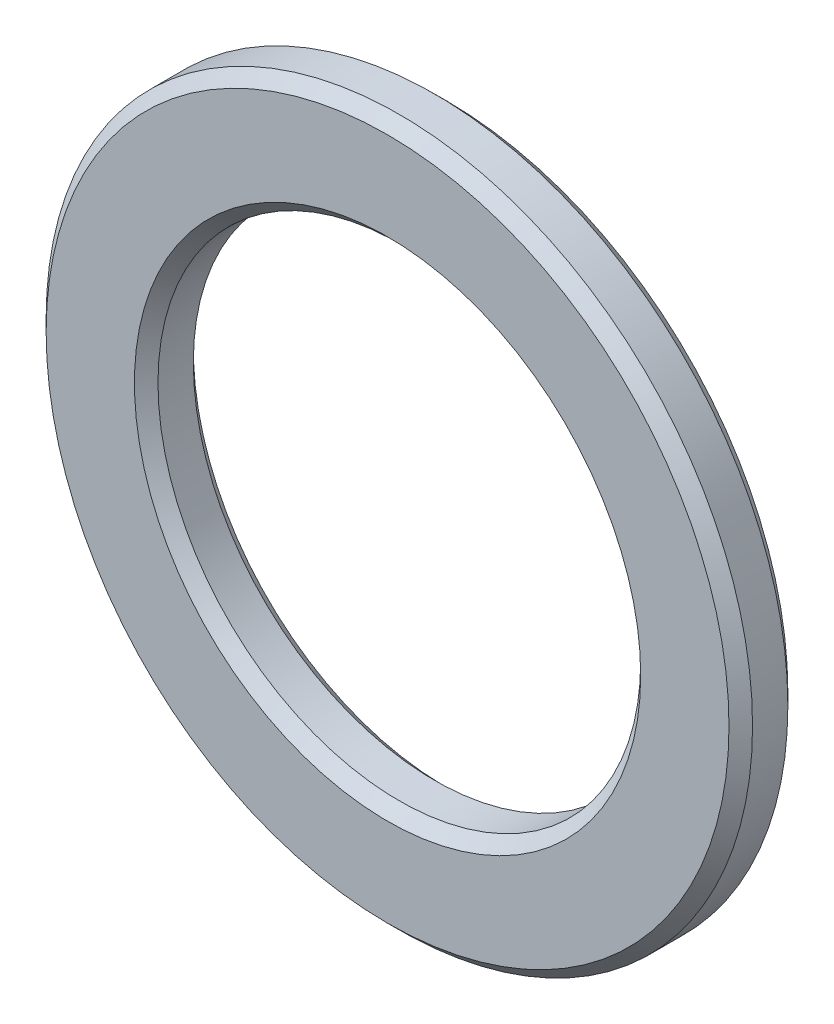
ISO-10303-21;
HEADER;
FILE_DESCRIPTION(('STEP AP214'),'2;1');
FILE_NAME('part.step','',(''),(''),'','','');
FILE_SCHEMA(('AUTOMOTIVE_DESIGN { 1 0 10303 214 1 1 1 1 }'));
ENDSEC;
DATA;
#1=APPLICATION_CONTEXT('core data for automotive mechanical design processes');
#2=APPLICATION_PROTOCOL_DEFINITION('international standard','automotive_design',2000,#1);
#3=PRODUCT_CONTEXT('',#1,'mechanical');
#4=PRODUCT('Part','Part','',(#3));
#5=PRODUCT_RELATED_PRODUCT_CATEGORY('part','',(#4));
#6=PRODUCT_DEFINITION_FORMATION('','',#4);
#7=PRODUCT_DEFINITION_CONTEXT('part definition',#1,'design');
#8=PRODUCT_DEFINITION('design','',#6,#7);
#9=PRODUCT_DEFINITION_SHAPE('','',#8);
#10=(LENGTH_UNIT() NAMED_UNIT(*) SI_UNIT(.MILLI.,.METRE.));
#11=(NAMED_UNIT(*) PLANE_ANGLE_UNIT() SI_UNIT($,.RADIAN.));
#12=(NAMED_UNIT(*) SI_UNIT($,.STERADIAN.) SOLID_ANGLE_UNIT());
#13=UNCERTAINTY_MEASURE_WITH_UNIT(LENGTH_MEASURE(1.E-05),#10,'distance_accuracy_value','');
#14=(GEOMETRIC_REPRESENTATION_CONTEXT(3) GLOBAL_UNCERTAINTY_ASSIGNED_CONTEXT((#13)) GLOBAL_UNIT_ASSIGNED_CONTEXT((#10,
#11,#12)) REPRESENTATION_CONTEXT('',''));
#15=CARTESIAN_POINT('',(0.,0.,0.));
#16=DIRECTION('',(0.,0.,1.));
#17=DIRECTION('',(1.,0.,0.));
#18=AXIS2_PLACEMENT_3D('',#15,#16,#17);
#19=CARTESIAN_POINT('',(0.,0.,0.5));
#20=DIRECTION('',(0.,0.,1.));
#21=DIRECTION('',(1.,0.,0.));
#22=AXIS2_PLACEMENT_3D('',#19,#20,#21);
#23=PLANE('',#22);
#24=CARTESIAN_POINT('',(0.,0.,0.5));
#25=DIRECTION('',(0.,0.,1.));
#26=DIRECTION('',(1.,0.,0.));
#27=AXIS2_PLACEMENT_3D('',#24,#25,#26);
#28=CIRCLE('',#27,4.3);
#29=CARTESIAN_POINT('',(4.3,0.,0.5));
#30=VERTEX_POINT('',#29);
#31=EDGE_CURVE('E10',#30,#30,#28,.F.);
#32=ORIENTED_EDGE('',*,*,#31,.T.);
#33=EDGE_LOOP('',(#32));
#34=FACE_BOUND('',#33,.T.);
#35=CARTESIAN_POINT('',(0.,0.,0.5));
#36=DIRECTION('',(0.,0.,1.));
#37=DIRECTION('',(1.,0.,0.));
#38=AXIS2_PLACEMENT_3D('',#35,#36,#37);
#39=CIRCLE('',#38,5.8);
#40=CARTESIAN_POINT('',(5.8,0.,0.5));
#41=VERTEX_POINT('',#40);
#42=EDGE_CURVE('E45',#41,#41,#39,.T.);
#43=ORIENTED_EDGE('',*,*,#42,.T.);
#44=EDGE_LOOP('',(#43));
#45=FACE_BOUND('',#44,.T.);
#46=ADVANCED_FACE('F37',(#34,#45),#23,.T.);
#47=CARTESIAN_POINT('',(0.,0.,-0.5));
#48=DIRECTION('',(0.,0.,1.));
#49=DIRECTION('',(1.,0.,0.));
#50=AXIS2_PLACEMENT_3D('',#47,#48,#49);
#51=PLANE('',#50);
#52=CARTESIAN_POINT('',(0.,0.,-0.5));
#53=DIRECTION('',(0.,0.,1.));
#54=DIRECTION('',(1.,0.,0.));
#55=AXIS2_PLACEMENT_3D('',#52,#53,#54);
#56=CIRCLE('',#55,5.8);
#57=CARTESIAN_POINT('',(5.8,0.,-0.5));
#58=VERTEX_POINT('',#57);
#59=EDGE_CURVE('E63',#58,#58,#56,.F.);
#60=ORIENTED_EDGE('',*,*,#59,.T.);
#61=EDGE_LOOP('',(#60));
#62=FACE_BOUND('',#61,.T.);
#63=CARTESIAN_POINT('',(0.,0.,-0.5));
#64=DIRECTION('',(0.,0.,1.));
#65=DIRECTION('',(1.,0.,0.));
#66=AXIS2_PLACEMENT_3D('',#63,#64,#65);
#67=CIRCLE('',#66,4.3);
#68=CARTESIAN_POINT('',(4.3,0.,-0.5));
#69=VERTEX_POINT('',#68);
#70=EDGE_CURVE('E66',#69,#69,#67,.T.);
#71=ORIENTED_EDGE('',*,*,#70,.T.);
#72=EDGE_LOOP('',(#71));
#73=FACE_BOUND('',#72,.T.);
#74=ADVANCED_FACE('F89',(#62,#73),#51,.F.);
#75=CARTESIAN_POINT('',(0.,0.,0.5));
#76=DIRECTION('',(0.,0.,-1.));
#77=DIRECTION('',(-1.,0.,0.));
#78=AXIS2_PLACEMENT_3D('',#75,#76,#77);
#79=CYLINDRICAL_SURFACE('',#78,6.);
#80=CARTESIAN_POINT('',(0.,0.,-0.299999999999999));
#81=DIRECTION('',(0.,0.,1.));
#82=DIRECTION('',(1.,0.,0.));
#83=AXIS2_PLACEMENT_3D('',#80,#81,#82);
#84=CIRCLE('',#83,6.);
#85=CARTESIAN_POINT('',(6.,0.,-0.299999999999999));
#86=VERTEX_POINT('',#85);
#87=EDGE_CURVE('E70',#86,#86,#84,.T.);
#88=ORIENTED_EDGE('',*,*,#87,.T.);
#89=EDGE_LOOP('',(#88));
#90=FACE_BOUND('',#89,.T.);
#91=CARTESIAN_POINT('',(0.,0.,0.299999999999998));
#92=DIRECTION('',(0.,0.,1.));
#93=DIRECTION('',(1.,0.,0.));
#94=AXIS2_PLACEMENT_3D('',#91,#92,#93);
#95=CIRCLE('',#94,6.);
#96=CARTESIAN_POINT('',(6.,0.,0.299999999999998));
#97=VERTEX_POINT('',#96);
#98=EDGE_CURVE('E74',#97,#97,#95,.F.);
#99=ORIENTED_EDGE('',*,*,#98,.T.);
#100=EDGE_LOOP('',(#99));
#101=FACE_BOUND('',#100,.T.);
#102=ADVANCED_FACE('F78',(#90,#101),#79,.T.);
#103=CARTESIAN_POINT('',(0.,0.,0.5));
#104=DIRECTION('',(0.,0.,-1.));
#105=DIRECTION('',(-1.,0.,0.));
#106=AXIS2_PLACEMENT_3D('',#103,#104,#105);
#107=CYLINDRICAL_SURFACE('',#106,4.1);
#108=CARTESIAN_POINT('',(0.,0.,-0.299999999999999));
#109=DIRECTION('',(0.,0.,1.));
#110=DIRECTION('',(1.,0.,0.));
#111=AXIS2_PLACEMENT_3D('',#108,#109,#110);
#112=CIRCLE('',#111,4.1);
#113=CARTESIAN_POINT('',(4.1,0.,-0.299999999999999));
#114=VERTEX_POINT('',#113);
#115=EDGE_CURVE('E52',#114,#114,#112,.F.);
#116=ORIENTED_EDGE('',*,*,#115,.T.);
#117=EDGE_LOOP('',(#116));
#118=FACE_BOUND('',#117,.T.);
#119=CARTESIAN_POINT('',(0.,0.,0.3));
#120=DIRECTION('',(0.,0.,1.));
#121=DIRECTION('',(1.,0.,0.));
#122=AXIS2_PLACEMENT_3D('',#119,#120,#121);
#123=CIRCLE('',#122,4.1);
#124=CARTESIAN_POINT('',(4.1,0.,0.3));
#125=VERTEX_POINT('',#124);
#126=EDGE_CURVE('E58',#125,#125,#123,.T.);
#127=ORIENTED_EDGE('',*,*,#126,.T.);
#128=EDGE_LOOP('',(#127));
#129=FACE_BOUND('',#128,.T.);
#130=ADVANCED_FACE('F97',(#118,#129),#107,.F.);
#131=CARTESIAN_POINT('',(0.,0.,-0.299999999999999));
#132=DIRECTION('',(0.,0.,1.));
#133=DIRECTION('',(1.,0.,0.));
#134=AXIS2_PLACEMENT_3D('',#131,#132,#133);
#135=CONICAL_SURFACE('',#134,6.,0.785398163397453);
#136=ORIENTED_EDGE('',*,*,#59,.F.);
#137=EDGE_LOOP('',(#136));
#138=FACE_BOUND('',#137,.T.);
#139=ORIENTED_EDGE('',*,*,#87,.F.);
#140=EDGE_LOOP('',(#139));
#141=FACE_BOUND('',#140,.T.);
#142=ADVANCED_FACE('F102',(#138,#141),#135,.T.);
#143=CARTESIAN_POINT('',(0.,0.,-0.5));
#144=DIRECTION('',(0.,0.,-1.));
#145=DIRECTION('',(-1.,0.,0.));
#146=AXIS2_PLACEMENT_3D('',#143,#144,#145);
#147=CONICAL_SURFACE('',#146,4.3,0.785398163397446);
#148=ORIENTED_EDGE('',*,*,#115,.F.);
#149=EDGE_LOOP('',(#148));
#150=FACE_BOUND('',#149,.T.);
#151=ORIENTED_EDGE('',*,*,#70,.F.);
#152=EDGE_LOOP('',(#151));
#153=FACE_BOUND('',#152,.T.);
#154=ADVANCED_FACE('F86',(#150,#153),#147,.F.);
#155=CARTESIAN_POINT('',(0.,0.,0.3));
#156=DIRECTION('',(0.,0.,1.));
#157=DIRECTION('',(1.,0.,0.));
#158=AXIS2_PLACEMENT_3D('',#155,#156,#157);
#159=CONICAL_SURFACE('',#158,4.1,0.785398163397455);
#160=CARTESIAN_POINT('',(4.3,0.,0.5));
#161=CARTESIAN_POINT('',(4.29791666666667,0.,0.497916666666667));
#162=CARTESIAN_POINT('',(4.29583333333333,0.,0.495833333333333));
#163=CARTESIAN_POINT('',(4.29166666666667,0.,0.491666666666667));
#164=CARTESIAN_POINT('',(4.28958333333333,0.,0.489583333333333));
#165=CARTESIAN_POINT('',(4.28541666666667,0.,0.485416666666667));
#166=CARTESIAN_POINT('',(4.28333333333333,0.,0.483333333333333));
#167=CARTESIAN_POINT('',(4.27916666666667,0.,0.479166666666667));
#168=CARTESIAN_POINT('',(4.27708333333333,0.,0.477083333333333));
#169=CARTESIAN_POINT('',(4.27291666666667,0.,0.472916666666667));
#170=CARTESIAN_POINT('',(4.27083333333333,0.,0.470833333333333));
#171=CARTESIAN_POINT('',(4.26666666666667,0.,0.466666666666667));
#172=CARTESIAN_POINT('',(4.26458333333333,0.,0.464583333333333));
#173=CARTESIAN_POINT('',(4.26041666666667,0.,0.460416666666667));
#174=CARTESIAN_POINT('',(4.25833333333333,0.,0.458333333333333));
#175=CARTESIAN_POINT('',(4.25416666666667,0.,0.454166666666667));
#176=CARTESIAN_POINT('',(4.25208333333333,0.,0.452083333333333));
#177=CARTESIAN_POINT('',(4.24791666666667,0.,0.447916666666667));
#178=CARTESIAN_POINT('',(4.24583333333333,0.,0.445833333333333));
#179=CARTESIAN_POINT('',(4.24166666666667,0.,0.441666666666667));
#180=CARTESIAN_POINT('',(4.23958333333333,0.,0.439583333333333));
#181=CARTESIAN_POINT('',(4.23541666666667,0.,0.435416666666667));
#182=CARTESIAN_POINT('',(4.23333333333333,0.,0.433333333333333));
#183=CARTESIAN_POINT('',(4.22916666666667,0.,0.429166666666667));
#184=CARTESIAN_POINT('',(4.22708333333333,0.,0.427083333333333));
#185=CARTESIAN_POINT('',(4.22291666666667,0.,0.422916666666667));
#186=CARTESIAN_POINT('',(4.22083333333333,0.,0.420833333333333));
#187=CARTESIAN_POINT('',(4.21666666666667,0.,0.416666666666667));
#188=CARTESIAN_POINT('',(4.21458333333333,0.,0.414583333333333));
#189=CARTESIAN_POINT('',(4.21041666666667,0.,0.410416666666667));
#190=CARTESIAN_POINT('',(4.20833333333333,0.,0.408333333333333));
#191=CARTESIAN_POINT('',(4.20416666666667,0.,0.404166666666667));
#192=CARTESIAN_POINT('',(4.20208333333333,0.,0.402083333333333));
#193=CARTESIAN_POINT('',(4.19791666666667,0.,0.397916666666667));
#194=CARTESIAN_POINT('',(4.19583333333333,0.,0.395833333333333));
#195=CARTESIAN_POINT('',(4.19166666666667,0.,0.391666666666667));
#196=CARTESIAN_POINT('',(4.18958333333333,0.,0.389583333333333));
#197=CARTESIAN_POINT('',(4.18541666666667,0.,0.385416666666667));
#198=CARTESIAN_POINT('',(4.18333333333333,0.,0.383333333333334));
#199=CARTESIAN_POINT('',(4.17916666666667,0.,0.379166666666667));
#200=CARTESIAN_POINT('',(4.17708333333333,0.,0.377083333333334));
#201=CARTESIAN_POINT('',(4.17291666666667,0.,0.372916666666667));
#202=CARTESIAN_POINT('',(4.17083333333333,0.,0.370833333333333));
#203=CARTESIAN_POINT('',(4.16666666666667,0.,0.366666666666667));
#204=CARTESIAN_POINT('',(4.16458333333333,0.,0.364583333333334));
#205=CARTESIAN_POINT('',(4.16041666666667,0.,0.360416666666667));
#206=CARTESIAN_POINT('',(4.15833333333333,0.,0.358333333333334));
#207=CARTESIAN_POINT('',(4.15416666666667,0.,0.354166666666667));
#208=CARTESIAN_POINT('',(4.15208333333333,0.,0.352083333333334));
#209=CARTESIAN_POINT('',(4.14791666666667,0.,0.347916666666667));
#210=CARTESIAN_POINT('',(4.14583333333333,0.,0.345833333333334));
#211=CARTESIAN_POINT('',(4.14166666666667,0.,0.341666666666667));
#212=CARTESIAN_POINT('',(4.13958333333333,0.,0.339583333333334));
#213=CARTESIAN_POINT('',(4.13541666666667,0.,0.335416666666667));
#214=CARTESIAN_POINT('',(4.13333333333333,0.,0.333333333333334));
#215=CARTESIAN_POINT('',(4.12916666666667,0.,0.329166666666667));
#216=CARTESIAN_POINT('',(4.12708333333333,0.,0.327083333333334));
#217=CARTESIAN_POINT('',(4.12291666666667,0.,0.322916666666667));
#218=CARTESIAN_POINT('',(4.12083333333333,0.,0.320833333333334));
#219=CARTESIAN_POINT('',(4.11666666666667,0.,0.316666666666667));
#220=CARTESIAN_POINT('',(4.11458333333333,0.,0.314583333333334));
#221=CARTESIAN_POINT('',(4.11041666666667,0.,0.310416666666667));
#222=CARTESIAN_POINT('',(4.10833333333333,0.,0.308333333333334));
#223=CARTESIAN_POINT('',(4.10416666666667,0.,0.304166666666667));
#224=CARTESIAN_POINT('',(4.10208333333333,0.,0.302083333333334));
#225=CARTESIAN_POINT('',(4.1,0.,0.3));
#226=B_SPLINE_CURVE_WITH_KNOTS('',3,(#160,#161,#162,#163,#164,#165,#166,#167,#168,#169,#170,
#171,#172,#173,#174,#175,#176,#177,#178,#179,#180,#181,#182,#183,#184,#185,#186,#187,#188,#189,
#190,#191,#192,#193,#194,#195,#196,#197,#198,#199,#200,#201,#202,#203,#204,#205,#206,#207,#208,
#209,#210,#211,#212,#213,#214,#215,#216,#217,#218,#219,#220,#221,#222,#223,#224,#225),
.UNSPECIFIED.,.F.,.F.,(4,2,2,2,2,2,2,2,2,2,2,2,2,2,2,2,2,2,2,2,2,2,2,2,2,2,2,2,2,2,2,2,4),(0.,
0.00883883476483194,0.0176776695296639,0.0265165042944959,0.0353553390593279,0.0441941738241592,
0.0530330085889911,0.0618718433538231,0.0707106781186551,0.079549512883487,0.088388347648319,
0.0972271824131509,0.106066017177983,0.114904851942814,0.123743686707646,0.132582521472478,
0.14142135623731,0.150260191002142,0.159099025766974,0.167937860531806,0.176776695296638,
0.185615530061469,0.194454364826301,0.203293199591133,0.212132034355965,0.220970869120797,
0.229809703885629,0.238648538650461,0.247487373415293,0.256326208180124,0.265165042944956,
0.274003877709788,0.28284271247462),.UNSPECIFIED.);
#227=EDGE_CURVE('BSEAM82',#30,#125,#226,.T.);
#228=ORIENTED_EDGE('',*,*,#31,.F.);
#229=ORIENTED_EDGE('',*,*,#126,.F.);
#230=ORIENTED_EDGE('',*,*,#227,.T.);
#231=ORIENTED_EDGE('',*,*,#227,.F.);
#232=EDGE_LOOP('',(#228,#230,#229,#231));
#233=FACE_BOUND('',#232,.T.);
#234=ADVANCED_FACE('F82',(#233),#159,.F.);
#235=CARTESIAN_POINT('',(0.,0.,0.5));
#236=DIRECTION('',(0.,0.,-1.));
#237=DIRECTION('',(-1.,0.,0.));
#238=AXIS2_PLACEMENT_3D('',#235,#236,#237);
#239=CONICAL_SURFACE('',#238,5.8,0.78539816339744);
#240=ORIENTED_EDGE('',*,*,#98,.F.);
#241=EDGE_LOOP('',(#240));
#242=FACE_BOUND('',#241,.T.);
#243=ORIENTED_EDGE('',*,*,#42,.F.);
#244=EDGE_LOOP('',(#243));
#245=FACE_BOUND('',#244,.T.);
#246=ADVANCED_FACE('F39',(#242,#245),#239,.T.);
#247=CLOSED_SHELL('',(#46,#74,#102,#130,#142,#154,#234,#246));
#248=MANIFOLD_SOLID_BREP('B2',#247);
#249=ADVANCED_BREP_SHAPE_REPRESENTATION('',(#18,#248),#14);
#250=SHAPE_DEFINITION_REPRESENTATION(#9,#249);
ENDSEC;
END-ISO-10303-21;
